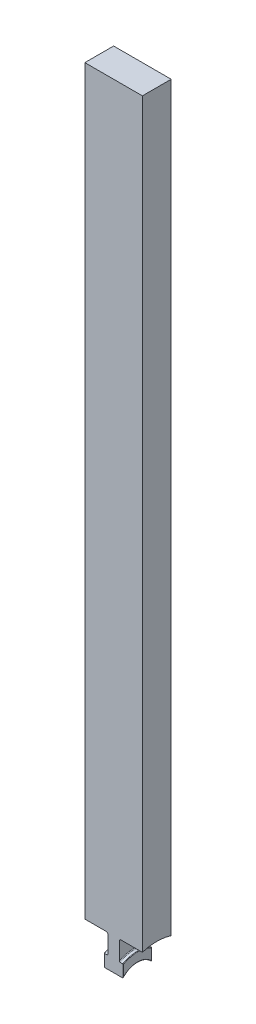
from build123d import *

# Parameters (mm, degrees)
SKETCH1_W               = 15
SKETCH1_H               = 410
BOSS_EXTRUDE1_DEPTH     = 15
CUT_EXTRUDE4_DEPTH      = 411.342844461
CUT_EXTRUDE4_DEPTH_BACK = 411.342844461
SKETCH8_R               = 10
SKETCH2_W               = 12
SKETCH2_H               = 9.5
CUT_EXTRUDE3_DEPTH      = 411.342844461
CUT_EXTRUDE3_DEPTH_BACK = 411.342844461
SKETCH7_W               = 10
SKETCH7_H               = 15
FILLET1_R               = 0.762
FILLET2_R               = 0.381
FILLET3_R               = 0.25


with BuildPart() as part:
    # Sketch1 → Boss-Extrude1 (new, symmetric)
    with BuildSketch(Plane(origin=(0, 0, 0), x_dir=(0, 0, -1), z_dir=(1, 0, 0))):
        with Locations((0, 205)):
            Rectangle(SKETCH1_W, SKETCH1_H)
    extrude(amount=BOSS_EXTRUDE1_DEPTH, both=True)

    # Sketch8 → Cut-Extrude4 (cut, two sides: drawn at the far end of the back side and taken through both)
    with BuildSketch(Plane(origin=(0, 0, 0), x_dir=(0, 0, -1), z_dir=(1, 0, 0)).offset(-CUT_EXTRUDE4_DEPTH_BACK)):
        Circle(SKETCH8_R)
    extrude(amount=CUT_EXTRUDE4_DEPTH + CUT_EXTRUDE4_DEPTH_BACK, mode=Mode.SUBTRACT)

    # Sketch2 → Cut-Revolve1 (revolve, cut)
    with BuildSketch(Plane.XY):
        with Locations((9, 19.75)):
            Rectangle(SKETCH2_W, SKETCH2_H)
        with Locations((-9, 19.75)):
            Rectangle(SKETCH2_W, SKETCH2_H)
    revolve(axis=Axis((-8.84822894, 0, 0), (1, 0, 0)), mode=Mode.SUBTRACT)

    # Sketch7 → Cut-Extrude3 (cut, two sides: drawn at the far end of the back side and taken through both)
    with BuildSketch(Plane.XY.offset(-CUT_EXTRUDE3_DEPTH_BACK)):
        with Locations((-10, 7.5)):
            Rectangle(SKETCH7_W, SKETCH7_H)
        with Locations((10, 7.5)):
            Rectangle(SKETCH7_W, SKETCH7_H)
    extrude(amount=CUT_EXTRUDE3_DEPTH + CUT_EXTRUDE3_DEPTH_BACK, mode=Mode.SUBTRACT)

    # Fillet1
    fillet1_edges = [part.edges().sort_by_distance(p)[0] for p in [
        (3, 24.5, 0),
        (-3, 24.5, 0),
    ]]
    fillet(fillet1_edges, radius=FILLET1_R)

    # Fillet2
    fillet2_edges = [part.edges().sort_by_distance(p)[0] for p in [
        (3, 15, 0),
        (-3, 15, 0),
    ]]
    fillet(fillet2_edges, radius=FILLET2_R)

    # Fillet3
    fillet3_edges = [part.edges().sort_by_distance(p)[0] for p in [
        (5, 15, 0),
        (-5, 15, 0),
        (-5, 10, 0),
        (-5, 9.802379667, -7.5),
        (-5, 9.802379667, 7.5),
        (5, 9.802379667, -7.5),
        (5, 10, 0),
        (5, 9.802379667, 7.5),
    ]]
    fillet(fillet3_edges, radius=FILLET3_R)


solid = part.part
